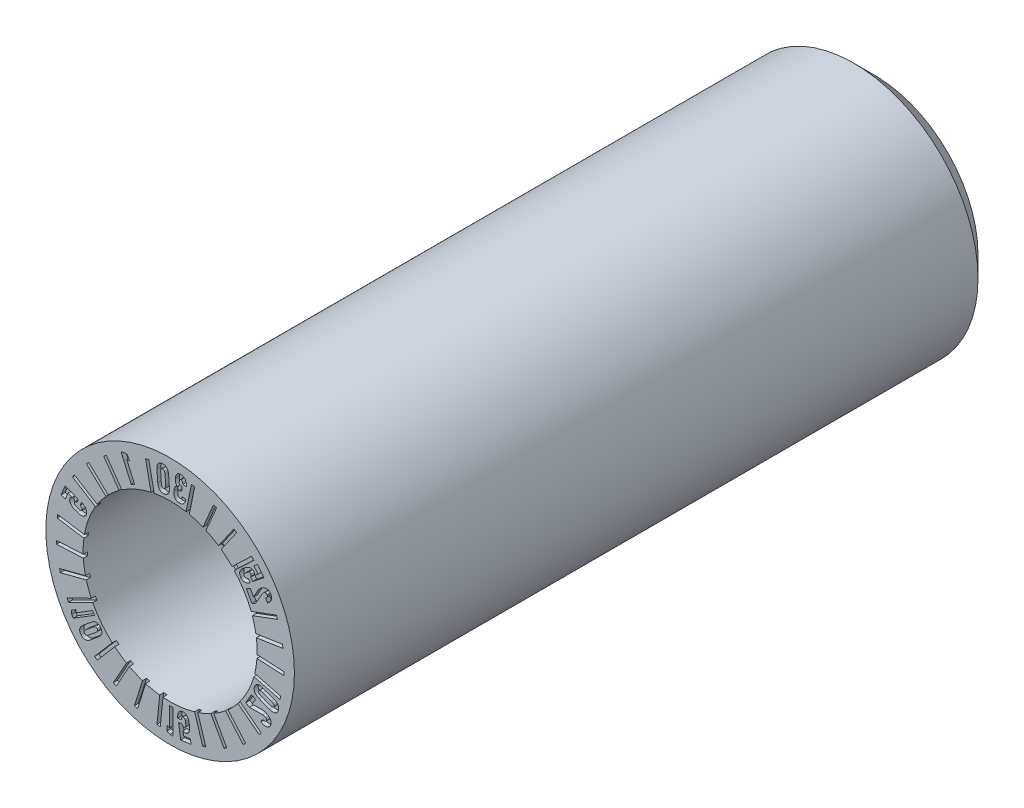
from build123d import *

# Parameters (mm, degrees)
CUT_EXTRUDE1_START = -0.1
CUT_EXTRUDE1_DEPTH = 0.1


with BuildPart() as part:
    # Sketch1 → Revolve1 (revolve)
    with BuildSketch(Plane(origin=(0, 0, 0), x_dir=(0, 0, -1), z_dir=(1, 0, 0)), mode=Mode.PRIVATE) as revolve1_sk:
        Polygon((17, 1.5), (17, 2.5), (16.5, 3), (0, 3), (0, 2.1), (3, 2.1), (3, 0.8), (12, 0.8), (12, 1.5), align=None)
    revolve(revolve1_sk.sketch.rotate(Axis((0, 0, 0), (0, 0, -1)), 90), axis=Axis((0, 0, 0), (0, 0, -1)))

    # Sketch2 → Cut-Extrude1 (cut)
    # profile 1 of 60: a face of its own
    with BuildSketch(Plane.XY.offset(CUT_EXTRUDE1_START)):
        with BuildLine():
            add(Edge.make_bspline(
                [(-2.022395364, 0.804520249), (-2.01781332, 0.815812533), (-2.013477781, 0.833704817), (-2.01341987, 0.85806027), (-2.016320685, 0.876172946), (-2.021922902, 0.894062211), (-2.030540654, 0.911444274), (-2.041835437, 0.928374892), (-2.055934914, 0.944651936), (-2.07263544, 0.96011942), (-2.099245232, 0.979670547), (-2.121459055, 0.992135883), (-2.137360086, 0.999292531)],
                knots=[0, 0, 0, 0, 0.145465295, 0.21709738, 0.289641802, 0.363737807, 0.440147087, 0.520570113, 0.6062151, 0.696770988, 0.791877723, 1, 1, 1, 1], degree=3))
            Line((-2.137360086, 0.999292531), (-2.137710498, 0.999455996))
            Line((-2.137710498, 0.999455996), (-2.170668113, 0.916824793))
            Line((-2.170668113, 0.916824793), (-2.170317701, 0.916661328))
            add(Edge.make_bspline(
                [(-2.170317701, 0.916661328), (-2.161410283, 0.912320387), (-2.149187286, 0.904909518), (-2.135753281, 0.89271284), (-2.12853878, 0.883357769), (-2.123509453, 0.87370954), (-2.120332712, 0.860279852), (-2.1220155, 0.850018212), (-2.124485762, 0.843782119)],
                knots=[0, 0, 0, 0, 0.312565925, 0.447531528, 0.56988102, 0.683318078, 0.788125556, 1, 1, 1, 1], degree=3))
            add(Edge.make_bspline(
                [(-2.124485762, 0.843782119), (-2.127095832, 0.837180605), (-2.133127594, 0.827911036), (-2.145416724, 0.82031004), (-2.15612953, 0.816952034), (-2.168256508, 0.815764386), (-2.187276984, 0.817205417), (-2.201611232, 0.822130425), (-2.211440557, 0.825764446)],
                knots=[0, 0, 0, 0, 0.214906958, 0.318693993, 0.428977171, 0.5498672, 0.683154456, 1, 1, 1, 1], degree=3))
            Line((-2.211440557, 0.825764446), (-2.258044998, 0.84430513))
            add(Edge.make_bspline(
                [(-2.258044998, 0.84430513), (-2.267724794, 0.848285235), (-2.281389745, 0.854540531), (-2.296245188, 0.866111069), (-2.304451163, 0.874645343), (-2.310015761, 0.88376576), (-2.314210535, 0.896367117), (-2.312569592, 0.906345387), (-2.310229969, 0.912254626)],
                knots=[0, 0, 0, 0, 0.329808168, 0.465965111, 0.588971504, 0.699113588, 0.798730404, 1, 1, 1, 1], degree=3))
            add(Edge.make_bspline(
                [(-2.310229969, 0.912254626), (-2.308043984, 0.917885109), (-2.303241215, 0.925607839), (-2.294470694, 0.933824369), (-2.286623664, 0.938333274), (-2.277983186, 0.941615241), (-2.264852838, 0.944076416), (-2.25452968, 0.943696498), (-2.247565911, 0.942499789)],
                knots=[0, 0, 0, 0, 0.238623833, 0.355233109, 0.472856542, 0.59497689, 0.720064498, 1, 1, 1, 1], degree=3))
            Line((-2.247565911, 0.942499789), (-2.216798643, 1.019795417))
            Line((-2.216798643, 1.019795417), (-2.53621781, 1.147170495))
            Line((-2.53621781, 1.147170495), (-2.630233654, 0.911517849))
            Line((-2.630233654, 0.911517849), (-2.529413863, 0.871270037))
            Line((-2.529413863, 0.871270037), (-2.468355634, 1.024291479))
            Line((-2.468355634, 1.024291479), (-2.370161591, 0.985183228))
            add(Edge.make_bspline(
                [(-2.370161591, 0.985183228), (-2.375294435, 0.983437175), (-2.382816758, 0.979757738), (-2.392013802, 0.973070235), (-2.39859832, 0.966882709), (-2.404757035, 0.960176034), (-2.411522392, 0.950406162), (-2.416017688, 0.94285381), (-2.417989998, 0.93735061)],
                knots=[0, 0, 0, 0, 0.233328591, 0.358376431, 0.488643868, 0.622173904, 0.749846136, 1, 1, 1, 1], degree=3))
            add(Edge.make_bspline(
                [(-2.417989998, 0.93735061), (-2.422117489, 0.926619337), (-2.426463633, 0.909827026), (-2.425375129, 0.887213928), (-2.421834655, 0.87082726), (-2.415035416, 0.854911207), (-2.405679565, 0.839318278), (-2.39302081, 0.824621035), (-2.377923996, 0.810274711), (-2.359896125, 0.79681305), (-2.331473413, 0.779003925), (-2.307638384, 0.768247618), (-2.290997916, 0.761501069)],
                knots=[0, 0, 0, 0, 0.142472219, 0.209677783, 0.277733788, 0.348186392, 0.422229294, 0.501188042, 0.586665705, 0.678727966, 0.778224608, 1, 1, 1, 1], degree=3))
            Line((-2.290997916, 0.761501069), (-2.244393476, 0.742960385))
            add(Edge.make_bspline(
                [(-2.244393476, 0.742960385), (-2.227713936, 0.736233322), (-2.202759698, 0.728223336), (-2.169522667, 0.722497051), (-2.146700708, 0.721127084), (-2.125279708, 0.722483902), (-2.105225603, 0.726154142), (-2.086818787, 0.732904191), (-2.070000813, 0.742122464), (-2.055031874, 0.754015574), (-2.037123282, 0.773686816), (-2.027504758, 0.7917498), (-2.022395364, 0.804520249)],
                knots=[0, 0, 0, 0, 0.207252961, 0.300633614, 0.387934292, 0.470002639, 0.547407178, 0.621957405, 0.694874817, 0.767458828, 0.841195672, 1, 1, 1, 1], degree=3))
        make_face()
    # profile 2 of 60: a face of its own
    with BuildSketch(Plane.XY.offset(CUT_EXTRUDE1_START)):
        Polygon((-2.377522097, -1.458745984), (-2.337512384, -1.523046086), (-1.826160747, -1.20528236), (-1.873013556, -1.129974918), (-2.271185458, -1.377430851), (-2.277833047, -1.314035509), (-2.380223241, -1.37766549), align=None)
    # profile 3 of 60: a face of its own
    with BuildSketch(Plane.XY.offset(CUT_EXTRUDE1_START)):
        with BuildLine():
            Line((-1.92967421, -1.773711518), (-1.720340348, -1.600493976))
            add(Edge.make_bspline(
                [(-1.720340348, -1.600493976), (-1.710545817, -1.592380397), (-1.696840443, -1.579829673), (-1.680916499, -1.561702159), (-1.670827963, -1.548412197), (-1.662446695, -1.534787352), (-1.655505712, -1.521149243), (-1.650340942, -1.507226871), (-1.64661603, -1.493303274), (-1.644502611, -1.479286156), (-1.644167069, -1.465323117), (-1.64570496, -1.451470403), (-1.648769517, -1.437710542), (-1.653730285, -1.424144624), (-1.662768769, -1.405708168), (-1.671891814, -1.392806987), (-1.678714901, -1.384496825)],
                knots=[0, 0, 0, 0, 0.152741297, 0.222475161, 0.289434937, 0.352771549, 0.414267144, 0.472825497, 0.530692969, 0.587013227, 0.642595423, 0.697849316, 0.753937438, 0.811416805, 0.870815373, 1, 1, 1, 1], degree=3))
            add(Edge.make_bspline(
                [(-1.678714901, -1.384496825), (-1.685653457, -1.376240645), (-1.696633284, -1.364719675), (-1.713140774, -1.352283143), (-1.725688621, -1.34494511), (-1.738643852, -1.339291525), (-1.75201935, -1.335343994), (-1.765844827, -1.333026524), (-1.780043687, -1.332601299), (-1.79450723, -1.333730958), (-1.809127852, -1.336253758), (-1.823843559, -1.340494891), (-1.838695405, -1.346279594), (-1.853659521, -1.353637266), (-1.874313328, -1.365792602), (-1.889110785, -1.376783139), (-1.898806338, -1.384794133)],
                knots=[0, 0, 0, 0, 0.129560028, 0.189938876, 0.247487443, 0.303619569, 0.359153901, 0.41444644, 0.471382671, 0.529169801, 0.588309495, 0.649122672, 0.712637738, 0.7793568, 0.849023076, 1, 1, 1, 1], degree=3))
            Line((-1.898806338, -1.384794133), (-2.1081402, -1.558011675))
            add(Edge.make_bspline(
                [(-2.1081402, -1.558011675), (-2.117834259, -1.5661758), (-2.131731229, -1.578544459), (-2.147522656, -1.596793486), (-2.157657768, -1.610088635), (-2.16601121, -1.623687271), (-2.172965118, -1.637322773), (-2.178263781, -1.651201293), (-2.182023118, -1.6651773), (-2.183936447, -1.679223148), (-2.184323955, -1.69318081), (-2.182774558, -1.707036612), (-2.179704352, -1.720791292), (-2.174770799, -1.734398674), (-2.165517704, -1.752756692), (-2.156516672, -1.765745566), (-2.149645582, -1.774031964)],
                knots=[0, 0, 0, 0, 0.15227182, 0.22239804, 0.289328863, 0.35263809, 0.413636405, 0.472734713, 0.530577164, 0.586896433, 0.642454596, 0.697684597, 0.753748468, 0.811202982, 0.870871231, 1, 1, 1, 1], degree=3))
            add(Edge.make_bspline(
                [(-2.149645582, -1.774031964), (-2.14284581, -1.782433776), (-2.131709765, -1.793671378), (-2.115395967, -1.806252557), (-2.102969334, -1.813625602), (-2.090094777, -1.819413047), (-2.076823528, -1.823513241), (-2.063069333, -1.825692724), (-2.049001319, -1.826438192), (-2.03458938, -1.825483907), (-2.02002787, -1.822639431), (-2.00525717, -1.818570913), (-1.990387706, -1.812716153), (-1.975323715, -1.805370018), (-1.954571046, -1.792871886), (-1.939491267, -1.781859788), (-1.92967421, -1.773711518)],
                knots=[0, 0, 0, 0, 0.129456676, 0.188898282, 0.24655354, 0.302262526, 0.357791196, 0.412540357, 0.468793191, 0.526396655, 0.585198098, 0.646387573, 0.70983958, 0.776492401, 0.847102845, 1, 1, 1, 1], degree=3))
        make_face()
        with BuildLine():
            Line((-2.029663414, -1.607628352), (-1.864771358, -1.471173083))
            add(Edge.make_bspline(
                [(-1.864771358, -1.471173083), (-1.854684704, -1.463230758), (-1.840190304, -1.451944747), (-1.819421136, -1.442224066), (-1.805904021, -1.437955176), (-1.793174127, -1.436766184), (-1.777156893, -1.439720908), (-1.767258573, -1.447400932), (-1.76228123, -1.453691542)],
                knots=[0, 0, 0, 0, 0.33149101, 0.467296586, 0.587731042, 0.694234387, 0.792721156, 1, 1, 1, 1], degree=3))
            add(Edge.make_bspline(
                [(-1.76228123, -1.453691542), (-1.757186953, -1.459795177), (-1.751317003, -1.470881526), (-1.751465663, -1.487173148), (-1.75507022, -1.499426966), (-1.761691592, -1.511954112), (-1.775242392, -1.530464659), (-1.78894228, -1.542687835), (-1.798720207, -1.551020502)],
                knots=[0, 0, 0, 0, 0.206456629, 0.305746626, 0.411944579, 0.53202433, 0.668485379, 1, 1, 1, 1], degree=3))
            Line((-1.798720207, -1.551020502), (-1.963612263, -1.687475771))
            add(Edge.make_bspline(
                [(-1.963612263, -1.687475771), (-1.973592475, -1.695553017), (-1.988281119, -1.706474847), (-2.008924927, -1.716452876), (-2.022480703, -1.720673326), (-2.035216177, -1.721926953), (-2.051152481, -1.718720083), (-2.061002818, -1.711150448), (-2.065959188, -1.704860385)],
                knots=[0, 0, 0, 0, 0.331136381, 0.46770859, 0.588275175, 0.694895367, 0.793495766, 1, 1, 1, 1], degree=3))
            add(Edge.make_bspline(
                [(-2.065959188, -1.704860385), (-2.071105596, -1.69876211), (-2.07681188, -1.68769037), (-2.07692137, -1.671462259), (-2.073492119, -1.659154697), (-2.066644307, -1.646731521), (-2.053188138, -1.628160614), (-2.039412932, -1.6159753), (-2.029663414, -1.607628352)],
                knots=[0, 0, 0, 0, 0.20658117, 0.305108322, 0.411292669, 0.531742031, 0.668285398, 1, 1, 1, 1], degree=3))
        make_face(mode=Mode.SUBTRACT)
    # profile 4 of 60: a face of its own
    with BuildSketch(Plane.XY.offset(CUT_EXTRUDE1_START)):
        with BuildLine():
            add(Edge.make_bspline(
                [(0.296313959, -2.155987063), (0.284237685, -2.157592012), (0.266528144, -2.162625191), (0.245489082, -2.174758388), (0.231257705, -2.186237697), (0.218557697, -2.199979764), (0.207712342, -2.216069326), (0.198638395, -2.234295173), (0.191454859, -2.254616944), (0.186283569, -2.276864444), (0.182102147, -2.309716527), (0.182600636, -2.335305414), (0.184120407, -2.352685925)],
                knots=[0, 0, 0, 0, 0.145429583, 0.216703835, 0.288639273, 0.362906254, 0.439218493, 0.519467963, 0.605325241, 0.695916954, 0.791618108, 1, 1, 1, 1], degree=3))
            Line((0.184120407, -2.352685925), (0.1841348, -2.353189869))
            Line((0.1841348, -2.353189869), (0.27213629, -2.340945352))
            Line((0.27213629, -2.340945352), (0.272121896, -2.340441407))
            add(Edge.make_bspline(
                [(0.272121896, -2.340441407), (0.271502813, -2.330516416), (0.271804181, -2.3162248), (0.275720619, -2.29848228), (0.28028634, -2.287595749), (0.286302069, -2.278535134), (0.296116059, -2.268909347), (0.306006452, -2.265533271), (0.312558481, -2.264582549)],
                knots=[0, 0, 0, 0, 0.31415548, 0.447734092, 0.571297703, 0.684465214, 0.789201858, 1, 1, 1, 1], degree=3))
            add(Edge.make_bspline(
                [(0.312558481, -2.264582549), (0.31958658, -2.263514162), (0.330541, -2.264320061), (0.343267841, -2.271124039), (0.351512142, -2.278795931), (0.358440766, -2.288907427), (0.366663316, -2.306154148), (0.369651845, -2.321062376), (0.371193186, -2.331440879)],
                knots=[0, 0, 0, 0, 0.214081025, 0.317152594, 0.428261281, 0.549099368, 0.68337942, 1, 1, 1, 1], degree=3))
            Line((0.371193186, -2.331440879), (0.378076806, -2.381323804))
            add(Edge.make_bspline(
                [(0.378076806, -2.381323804), (0.379396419, -2.391772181), (0.380555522, -2.406790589), (0.378029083, -2.425530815), (0.374702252, -2.436882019), (0.369671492, -2.44635661), (0.360531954, -2.455969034), (0.351239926, -2.459671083), (0.344913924, -2.460475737)],
                knots=[0, 0, 0, 0, 0.330824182, 0.467449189, 0.590332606, 0.699566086, 0.800283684, 1, 1, 1, 1], degree=3))
            add(Edge.make_bspline(
                [(0.344913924, -2.460475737), (0.338925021, -2.461565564), (0.329928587, -2.460927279), (0.318487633, -2.457453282), (0.310773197, -2.452837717), (0.303550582, -2.446958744), (0.295003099, -2.436587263), (0.290024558, -2.427482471), (0.287678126, -2.420782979)],
                knots=[0, 0, 0, 0, 0.238586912, 0.352754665, 0.470329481, 0.592128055, 0.719980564, 1, 1, 1, 1], degree=3))
            Line((0.287678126, -2.420782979), (0.205525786, -2.432148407))
            Line((0.205525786, -2.432148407), (0.252788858, -2.7739679))
            Line((0.252788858, -2.7739679), (0.503413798, -2.739337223))
            Line((0.503413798, -2.739337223), (0.488493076, -2.631386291))
            Line((0.488493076, -2.631386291), (0.325902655, -2.653890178))
            Line((0.325902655, -2.653890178), (0.311421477, -2.54886382))
            add(Edge.make_bspline(
                [(0.311421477, -2.54886382), (0.315494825, -2.552367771), (0.322149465, -2.557519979), (0.332644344, -2.561890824), (0.349504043, -2.567350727), (0.364614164, -2.568504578), (0.376318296, -2.566976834)],
                knots=[0, 0, 0, 0, 0.233613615, 0.358922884, 0.489992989, 1, 1, 1, 1], degree=3))
            add(Edge.make_bspline(
                [(0.376318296, -2.566976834), (0.38765119, -2.565277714), (0.404333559, -2.560638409), (0.423566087, -2.548625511), (0.43594684, -2.537250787), (0.446482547, -2.523559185), (0.455176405, -2.507611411), (0.46185632, -2.489416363), (0.466719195, -2.469128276), (0.46949407, -2.446803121), (0.470765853, -2.413189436), (0.468593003, -2.387077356), (0.466111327, -2.369197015)],
                knots=[0, 0, 0, 0, 0.141613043, 0.209642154, 0.277704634, 0.347723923, 0.421602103, 0.500666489, 0.585896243, 0.678164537, 0.777439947, 1, 1, 1, 1], degree=3))
            Line((0.466111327, -2.369197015), (0.459227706, -2.31931409))
            add(Edge.make_bspline(
                [(0.459227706, -2.31931409), (0.456954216, -2.30137389), (0.451254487, -2.275770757), (0.440123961, -2.243816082), (0.429999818, -2.223234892), (0.418427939, -2.205044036), (0.405107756, -2.189566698), (0.390284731, -2.176796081), (0.373995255, -2.166687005), (0.356301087, -2.159479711), (0.330372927, -2.153548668), (0.309925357, -2.154304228), (0.296313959, -2.155987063)],
                knots=[0, 0, 0, 0, 0.207840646, 0.300930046, 0.388682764, 0.471158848, 0.548363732, 0.622764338, 0.695449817, 0.767965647, 0.841624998, 1, 1, 1, 1], degree=3))
        make_face()
    # profile 5 of 60: a face of its own
    with BuildSketch(Plane.XY.offset(CUT_EXTRUDE1_START)):
        Polygon((-0.003158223, -2.787292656), (0.072895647, -2.786876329), (0.069760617, -2.186880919), (-0.019254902, -2.187287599), (-0.016784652, -2.654493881), (-0.074493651, -2.627115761), (-0.073816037, -2.747310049), align=None)
    # profile 6 of 60: a face of its own
    with BuildSketch(Plane.XY.offset(CUT_EXTRUDE1_START)):
        with BuildLine():
            Line((2.501052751, -0.791415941), (2.246824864, -0.694432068))
            add(Edge.make_bspline(
                [(2.246824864, -0.694432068), (2.234993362, -0.689768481), (2.217214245, -0.684290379), (2.193578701, -0.679279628), (2.176945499, -0.677232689), (2.160965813, -0.676630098), (2.145624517, -0.677247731), (2.130916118, -0.679663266), (2.116891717, -0.683395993), (2.103568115, -0.688567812), (2.091270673, -0.695433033), (2.079791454, -0.703568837), (2.06934692, -0.713268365), (2.059932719, -0.724481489), (2.04817182, -0.741659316), (2.041515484, -0.756240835), (2.037508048, -0.766331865)],
                knots=[0, 0, 0, 0, 0.151550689, 0.221424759, 0.287888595, 0.351122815, 0.411965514, 0.470651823, 0.52848452, 0.584787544, 0.640599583, 0.696012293, 0.752212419, 0.810061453, 0.870289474, 1, 1, 1, 1], degree=3))
            add(Edge.make_bspline(
                [(2.037508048, -0.766331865), (2.033771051, -0.77662202), (2.028985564, -0.792012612), (2.026262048, -0.812756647), (2.025953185, -0.827428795), (2.02743266, -0.841669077), (2.030451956, -0.85545322), (2.035278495, -0.868733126), (2.041839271, -0.881419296), (2.049772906, -0.89365907), (2.059409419, -0.905094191), (2.070305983, -0.915935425), (2.082525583, -0.926218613), (2.096318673, -0.93560716), (2.117153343, -0.947505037), (2.133960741, -0.955174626), (2.145789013, -0.959582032)],
                knots=[0, 0, 0, 0, 0.130722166, 0.19095447, 0.248869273, 0.305247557, 0.361220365, 0.416667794, 0.473144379, 0.531138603, 0.590165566, 0.651019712, 0.714195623, 0.780242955, 0.849607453, 1, 1, 1, 1], degree=3))
            Line((2.145789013, -0.959582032), (2.4000169, -1.056565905))
            add(Edge.make_bspline(
                [(2.4000169, -1.056565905), (2.411898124, -1.061184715), (2.429677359, -1.066807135), (2.453356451, -1.071787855), (2.470011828, -1.073876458), (2.48605406, -1.07435749), (2.501440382, -1.073628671), (2.51617935, -1.071237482), (2.530203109, -1.067497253), (2.543526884, -1.062327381), (2.555824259, -1.055461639), (2.567303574, -1.047326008), (2.577747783, -1.037626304), (2.587163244, -1.026413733), (2.598924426, -1.009222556), (2.605617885, -0.994642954), (2.609494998, -0.984482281)],
                knots=[0, 0, 0, 0, 0.151800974, 0.221588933, 0.287970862, 0.351434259, 0.412540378, 0.471154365, 0.528915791, 0.585149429, 0.640892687, 0.696237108, 0.752367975, 0.810145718, 0.870299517, 1, 1, 1, 1], degree=3))
            add(Edge.make_bspline(
                [(2.609494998, -0.984482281), (2.613384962, -0.974299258), (2.618051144, -0.958916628), (2.620698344, -0.938224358), (2.621270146, -0.92358373), (2.619830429, -0.909394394), (2.616943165, -0.895641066), (2.612045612, -0.882450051), (2.605757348, -0.869700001), (2.597852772, -0.857552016), (2.588289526, -0.846167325), (2.577446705, -0.835317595), (2.565024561, -0.825151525), (2.551187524, -0.815623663), (2.530115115, -0.803521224), (2.51300623, -0.795974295), (2.501052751, -0.791415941)],
                knots=[0, 0, 0, 0, 0.129965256, 0.19013335, 0.248047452, 0.304011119, 0.35953323, 0.41492155, 0.471070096, 0.528535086, 0.587019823, 0.647809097, 0.710930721, 0.777871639, 0.847638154, 1, 1, 1, 1], degree=3))
        make_face()
        with BuildLine():
            Line((2.405065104, -0.962745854), (2.204515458, -0.8863427))
            add(Edge.make_bspline(
                [(2.204515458, -0.8863427), (2.19254902, -0.881655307), (2.175803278, -0.874185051), (2.15690078, -0.861150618), (2.146535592, -0.851364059), (2.139390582, -0.84072322), (2.133972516, -0.825196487), (2.136220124, -0.812652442), (2.138989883, -0.80510443)],
                knots=[0, 0, 0, 0, 0.329551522, 0.465923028, 0.586028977, 0.692049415, 0.791149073, 1, 1, 1, 1], degree=3))
            add(Edge.make_bspline(
                [(2.138989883, -0.80510443), (2.141713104, -0.797493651), (2.148663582, -0.787006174), (2.162869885, -0.778826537), (2.175321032, -0.775681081), (2.189594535, -0.775353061), (2.212408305, -0.778082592), (2.229884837, -0.783823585), (2.241949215, -0.788240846)],
                knots=[0, 0, 0, 0, 0.207711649, 0.306685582, 0.41345721, 0.533002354, 0.670180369, 1, 1, 1, 1], degree=3))
            Line((2.241949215, -0.788240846), (2.44249886, -0.864644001))
            add(Edge.make_bspline(
                [(2.44249886, -0.864644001), (2.454471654, -0.869327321), (2.47120052, -0.876808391), (2.490092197, -0.889805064), (2.500411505, -0.89961586), (2.507673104, -0.910227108), (2.512806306, -0.925847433), (2.510966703, -0.938311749), (2.507932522, -0.945801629)],
                knots=[0, 0, 0, 0, 0.329799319, 0.466273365, 0.585427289, 0.692534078, 0.792239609, 1, 1, 1, 1], degree=3))
            add(Edge.make_bspline(
                [(2.507932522, -0.945801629), (2.505098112, -0.953380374), (2.498331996, -0.964042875), (2.484080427, -0.972302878), (2.471546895, -0.975132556), (2.457335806, -0.97572236), (2.434557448, -0.972761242), (2.417060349, -0.967466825), (2.405065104, -0.962745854)],
                knots=[0, 0, 0, 0, 0.208706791, 0.307671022, 0.414156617, 0.53441162, 0.670124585, 1, 1, 1, 1], degree=3))
        make_face(mode=Mode.SUBTRACT)
    # profile 7 of 60: a face of its own
    with BuildSketch(Plane.XY.offset(CUT_EXTRUDE1_START)):
        with BuildLine():
            Line((1.823590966, -1.208574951), (1.911819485, -1.260016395))
            Line((1.911819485, -1.260016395), (2.227731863, -1.25654448))
            add(Edge.make_bspline(
                [(2.227731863, -1.25654448), (2.241409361, -1.256395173), (2.267336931, -1.258598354), (2.291877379, -1.26737981), (2.302417, -1.273434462)],
                knots=[0, 0, 0, 0, 0.530461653, 1, 1, 1, 1], degree=3))
            Line((2.302417, -1.273434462), (2.303041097, -1.273779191))
            add(Edge.make_bspline(
                [(2.303041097, -1.273779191), (2.309332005, -1.277503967), (2.317959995, -1.283806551), (2.326102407, -1.294759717), (2.329725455, -1.303279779), (2.331437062, -1.312296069), (2.33032314, -1.325256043), (2.326634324, -1.334617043), (2.323074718, -1.340471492)],
                knots=[0, 0, 0, 0, 0.277860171, 0.397297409, 0.512307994, 0.6255352, 0.741072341, 1, 1, 1, 1], degree=3))
            add(Edge.make_bspline(
                [(2.323074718, -1.340471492), (2.319729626, -1.346514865), (2.312554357, -1.354394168), (2.299797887, -1.360313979), (2.288943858, -1.362492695), (2.276912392, -1.362478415), (2.258490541, -1.359910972), (2.244874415, -1.354226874), (2.2356266, -1.350070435)],
                knots=[0, 0, 0, 0, 0.213063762, 0.316457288, 0.42888981, 0.551528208, 0.685737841, 1, 1, 1, 1], degree=3))
            Line((2.2356266, -1.350070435), (2.23523099, -1.34987587))
            Line((2.23523099, -1.34987587), (2.189127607, -1.428787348))
            Line((2.189127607, -1.428787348), (2.189523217, -1.428981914))
            add(Edge.make_bspline(
                [(2.189523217, -1.428981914), (2.205223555, -1.436844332), (2.228667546, -1.447543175), (2.260826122, -1.456003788), (2.283319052, -1.459799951), (2.304848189, -1.460757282), (2.325266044, -1.459361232), (2.344435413, -1.455103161), (2.362240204, -1.448168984), (2.378670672, -1.438903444), (2.398433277, -1.422625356), (2.410426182, -1.40730195), (2.416926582, -1.396001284)],
                knots=[0, 0, 0, 0, 0.206025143, 0.299834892, 0.388679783, 0.47260667, 0.551578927, 0.627647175, 0.701554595, 0.774570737, 0.847535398, 1, 1, 1, 1], degree=3))
            add(Edge.make_bspline(
                [(2.416926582, -1.396001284), (2.42388208, -1.38413685), (2.432420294, -1.365733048), (2.438180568, -1.340061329), (2.439573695, -1.321634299), (2.438355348, -1.303534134), (2.433886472, -1.286047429), (2.427113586, -1.268957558), (2.417189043, -1.252719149), (2.404872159, -1.237041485), (2.38394223, -1.21693372), (2.365543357, -1.204047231), (2.352248, -1.196318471)],
                knots=[0, 0, 0, 0, 0.173312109, 0.25281544, 0.32993306, 0.405183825, 0.480015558, 0.556187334, 0.635703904, 0.718622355, 0.806489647, 1, 1, 1, 1], degree=3))
            Line((2.352248, -1.196318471), (2.35185239, -1.196123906))
            add(Edge.make_bspline(
                [(2.35185239, -1.196123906), (2.340038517, -1.189358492), (2.321664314, -1.180182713), (2.295942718, -1.170682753), (2.276150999, -1.16464787), (2.256149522, -1.160170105), (2.229902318, -1.156027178), (2.210219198, -1.154908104), (2.19721798, -1.155219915)],
                knots=[0, 0, 0, 0, 0.252379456, 0.379565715, 0.507830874, 0.635581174, 0.759100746, 1, 1, 1, 1], degree=3))
            Line((2.19721798, -1.155219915), (1.977314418, -1.161655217))
            Line((1.977314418, -1.161655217), (2.058872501, -1.022026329))
            Line((2.058872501, -1.022026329), (1.964614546, -0.96701487))
            Line((1.964614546, -0.96701487), (1.823590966, -1.208574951))
        make_face()
    # profile 8 of 60: a face of its own
    with BuildSketch(Plane.XY.offset(CUT_EXTRUDE1_START)):
        with BuildLine():
            add(Edge.make_bspline(
                [(1.707847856, 1.349235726), (1.715296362, 1.339468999), (1.728834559, 1.326895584), (1.749951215, 1.314617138), (1.767112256, 1.307980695), (1.785524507, 1.303997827), (1.805024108, 1.302633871), (1.82544781, 1.304204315), (1.846720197, 1.308184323), (1.868568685, 1.314947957), (1.899093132, 1.328063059), (1.921088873, 1.341280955), (1.935356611, 1.351486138)],
                knots=[0, 0, 0, 0, 0.145564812, 0.216803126, 0.289117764, 0.363216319, 0.439795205, 0.520501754, 0.605900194, 0.696417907, 0.791615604, 1, 1, 1, 1], degree=3))
            Line((1.935356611, 1.351486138), (1.935651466, 1.351666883))
            Line((1.935651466, 1.351666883), (1.880325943, 1.421903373))
            Line((1.880325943, 1.421903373), (1.880031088, 1.421722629))
            add(Edge.make_bspline(
                [(1.880031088, 1.421722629), (1.871684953, 1.416333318), (1.859223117, 1.409048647), (1.841735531, 1.403759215), (1.829982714, 1.402013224), (1.819062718, 1.402618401), (1.805873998, 1.406624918), (1.797659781, 1.412994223), (1.793611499, 1.418440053)],
                knots=[0, 0, 0, 0, 0.313121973, 0.447855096, 0.57140233, 0.684352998, 0.788182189, 1, 1, 1, 1], degree=3))
            add(Edge.make_bspline(
                [(1.793611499, 1.418440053), (1.789116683, 1.424020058), (1.784215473, 1.433951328), (1.783723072, 1.448448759), (1.786068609, 1.459464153), (1.791185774, 1.470651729), (1.802124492, 1.486405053), (1.813327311, 1.496723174), (1.82163249, 1.503258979)],
                knots=[0, 0, 0, 0, 0.215103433, 0.317748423, 0.428740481, 0.549005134, 0.683264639, 1, 1, 1, 1], degree=3))
            Line((1.82163249, 1.503258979), (1.861313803, 1.534479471))
            add(Edge.make_bspline(
                [(1.861313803, 1.534479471), (1.869626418, 1.540911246), (1.882007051, 1.549515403), (1.899477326, 1.556798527), (1.911083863, 1.559456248), (1.921828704, 1.559861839), (1.934844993, 1.556820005), (1.942807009, 1.550665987), (1.946710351, 1.545552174)],
                knots=[0, 0, 0, 0, 0.328896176, 0.4665944, 0.588364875, 0.698843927, 0.799356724, 1, 1, 1, 1], degree=3))
            add(Edge.make_bspline(
                [(1.946710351, 1.545552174), (1.950535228, 1.540837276), (1.954889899, 1.532837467), (1.957540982, 1.5211023), (1.957533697, 1.512101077), (1.956172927, 1.502906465), (1.951545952, 1.490317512), (1.946153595, 1.481483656), (1.941706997, 1.475958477)],
                knots=[0, 0, 0, 0, 0.239591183, 0.354231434, 0.472311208, 0.593604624, 0.720007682, 1, 1, 1, 1], degree=3))
            Line((1.941706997, 1.475958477), (1.993370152, 1.410373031))
            Line((1.993370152, 1.410373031), (2.265132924, 1.62432186))
            Line((2.265132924, 1.62432186), (2.107560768, 1.824464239))
            Line((2.107560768, 1.824464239), (2.021692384, 1.75691972))
            Line((2.021692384, 1.75691972), (2.123939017, 1.627013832))
            Line((2.123939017, 1.627013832), (2.040367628, 1.561181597))
            add(Edge.make_bspline(
                [(2.040367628, 1.561181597), (2.041432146, 1.566520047), (2.042266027, 1.574914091), (2.040952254, 1.586270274), (2.038911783, 1.595105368), (2.036092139, 1.603794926), (2.031298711, 1.614715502), (2.026625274, 1.622219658), (2.023046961, 1.626826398)],
                knots=[0, 0, 0, 0, 0.233920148, 0.358398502, 0.489028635, 0.622519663, 0.749852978, 1, 1, 1, 1], degree=3))
            add(Edge.make_bspline(
                [(2.023046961, 1.626826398), (2.01590776, 1.635880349), (2.003310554, 1.647819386), (1.983217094, 1.658567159), (1.96701365, 1.663489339), (1.949820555, 1.665842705), (1.931541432, 1.665283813), (1.912350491, 1.661805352), (1.8922287, 1.655718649), (1.8714132, 1.64693008), (1.841709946, 1.631009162), (1.820342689, 1.615809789), (1.806107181, 1.604687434)],
                knots=[0, 0, 0, 0, 0.141546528, 0.209725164, 0.277898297, 0.348272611, 0.421797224, 0.501331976, 0.586948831, 0.679288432, 0.778148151, 1, 1, 1, 1], degree=3))
            Line((1.806107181, 1.604687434), (1.766425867, 1.573466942))
            add(Edge.make_bspline(
                [(1.766425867, 1.573466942), (1.752271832, 1.562214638), (1.732508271, 1.544714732), (1.710826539, 1.518571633), (1.698085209, 1.499425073), (1.688263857, 1.480176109), (1.681725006, 1.460783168), (1.677981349, 1.441452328), (1.677498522, 1.422160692), (1.680394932, 1.40311477), (1.688477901, 1.377609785), (1.699338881, 1.360112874), (1.707847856, 1.349235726)],
                knots=[0, 0, 0, 0, 0.207301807, 0.300824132, 0.388238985, 0.470211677, 0.547546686, 0.621857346, 0.694915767, 0.767378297, 0.841505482, 1, 1, 1, 1], degree=3))
        make_face()
    # profile 9 of 60: a face of its own
    with BuildSketch(Plane.XY.offset(CUT_EXTRUDE1_START)):
        with BuildLine():
            Line((1.975026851, 0.940570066), (2.063677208, 0.989941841))
            Line((2.063677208, 0.989941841), (2.220668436, 1.261941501))
            add(Edge.make_bspline(
                [(2.220668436, 1.261941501), (2.227568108, 1.273642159), (2.242562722, 1.294703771), (2.262438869, 1.31135686), (2.273070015, 1.317176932)],
                knots=[0, 0, 0, 0, 0.529779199, 1, 1, 1, 1], degree=3))
            Line((2.273070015, 1.317176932), (2.273600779, 1.317566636))
            add(Edge.make_bspline(
                [(2.273600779, 1.317566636), (2.27994891, 1.321074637), (2.289763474, 1.325278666), (2.303265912, 1.326408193), (2.312375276, 1.32531722), (2.320973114, 1.322262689), (2.331563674, 1.314848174), (2.337672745, 1.306888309), (2.340857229, 1.300892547)],
                knots=[0, 0, 0, 0, 0.277882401, 0.397736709, 0.51234836, 0.625008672, 0.741538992, 1, 1, 1, 1], degree=3))
            add(Edge.make_bspline(
                [(2.340857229, 1.300892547), (2.344049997, 1.29492353), (2.347436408, 1.284819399), (2.345894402, 1.270893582), (2.342228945, 1.260488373), (2.336286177, 1.250147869), (2.324600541, 1.235848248), (2.312989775, 1.22700689), (2.304684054, 1.221291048)],
                knots=[0, 0, 0, 0, 0.211858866, 0.317642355, 0.429326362, 0.552125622, 0.685953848, 1, 1, 1, 1], degree=3))
            Line((2.304684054, 1.221291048), (2.304386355, 1.221044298))
            Line((2.304386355, 1.221044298), (2.348519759, 1.141561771))
            Line((2.348519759, 1.141561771), (2.348817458, 1.14180852))
            add(Edge.make_bspline(
                [(2.348817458, 1.14180852), (2.363674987, 1.151064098), (2.384356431, 1.16612874), (2.408173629, 1.189071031), (2.422673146, 1.206515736), (2.434504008, 1.224391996), (2.443426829, 1.242693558), (2.449739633, 1.261158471), (2.452780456, 1.279924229), (2.452974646, 1.298613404), (2.449537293, 1.32381828), (2.442034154, 1.341721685), (2.435866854, 1.353074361)],
                knots=[0, 0, 0, 0, 0.206170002, 0.300119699, 0.388776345, 0.472799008, 0.551941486, 0.627965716, 0.701775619, 0.774794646, 0.847376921, 1, 1, 1, 1], degree=3))
            add(Edge.make_bspline(
                [(2.435866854, 1.353074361), (2.429214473, 1.364983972), (2.417856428, 1.381701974), (2.39874091, 1.399548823), (2.383722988, 1.41019911), (2.367525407, 1.418010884), (2.350424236, 1.42352088), (2.332311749, 1.425949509), (2.313389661, 1.425941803), (2.293781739, 1.423199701), (2.265978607, 1.41556865), (2.245607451, 1.406443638), (2.232328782, 1.398868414)],
                knots=[0, 0, 0, 0, 0.173120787, 0.253079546, 0.3300875, 0.405319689, 0.479922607, 0.556637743, 0.635686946, 0.718879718, 0.806511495, 1, 1, 1, 1], degree=3))
            Line((2.232328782, 1.398868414), (2.231927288, 1.398686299))
            add(Edge.make_bspline(
                [(2.231927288, 1.398686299), (2.220114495, 1.392066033), (2.203037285, 1.380897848), (2.181813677, 1.363773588), (2.166720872, 1.349829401), (2.152576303, 1.335132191), (2.135983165, 1.31459996), (2.124783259, 1.298530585), (2.118675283, 1.287138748)],
                knots=[0, 0, 0, 0, 0.252437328, 0.379585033, 0.508099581, 0.635390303, 0.759540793, 1, 1, 1, 1], degree=3))
            Line((2.118675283, 1.287138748), (2.012786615, 1.095814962))
            Line((2.012786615, 1.095814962), (1.934659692, 1.236366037))
            Line((1.934659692, 1.236366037), (1.839871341, 1.1836143))
            Line((1.839871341, 1.1836143), (1.975026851, 0.940570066))
        make_face()
    # profile 10 of 60: a face of its own
    with BuildSketch(Plane.XY.offset(CUT_EXTRUDE1_START)):
        Polygon((-1.112774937, 2.557267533), (-1.182550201, 2.526510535), (-0.939553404, 1.976212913), (-0.857826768, 2.01229894), (-1.046990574, 2.440771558), (-0.983098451, 2.438702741), (-1.031701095, 2.548831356), align=None)
    # profile 11 of 60: a face of its own
    with BuildSketch(Plane.XY.offset(CUT_EXTRUDE1_START)):
        with BuildLine():
            Line((-0.318291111, 2.605057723), (-0.300053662, 2.332240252))
            add(Edge.make_bspline(
                [(-0.300053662, 2.332240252), (-0.299381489, 2.319483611), (-0.296946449, 2.300944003), (-0.291632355, 2.277277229), (-0.286660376, 2.26116898), (-0.280418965, 2.246348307), (-0.273267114, 2.23262733), (-0.265039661, 2.220110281), (-0.255720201, 2.208895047), (-0.245495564, 2.1989089), (-0.23412308, 2.190613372), (-0.222032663, 2.183422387), (-0.208795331, 2.178134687), (-0.194765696, 2.174010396), (-0.174216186, 2.170850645), (-0.158276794, 2.17050597), (-0.147433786, 2.171300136)],
                knots=[0, 0, 0, 0, 0.151887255, 0.222003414, 0.288414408, 0.352171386, 0.413075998, 0.472289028, 0.530015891, 0.58628839, 0.641843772, 0.697136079, 0.753197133, 0.810954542, 0.870781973, 1, 1, 1, 1], degree=3))
            add(Edge.make_bspline(
                [(-0.147433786, 2.171300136), (-0.136493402, 2.171867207), (-0.120661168, 2.174427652), (-0.100670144, 2.180365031), (-0.087285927, 2.186317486), (-0.074981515, 2.193572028), (-0.06368387, 2.202090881), (-0.053807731, 2.212248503), (-0.04489875, 2.223463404), (-0.037202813, 2.235903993), (-0.030769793, 2.249419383), (-0.025549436, 2.263949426), (-0.021537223, 2.279463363), (-0.018504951, 2.295966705), (-0.016521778, 2.319999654), (-0.016643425, 2.338543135), (-0.017460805, 2.351186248)],
                knots=[0, 0, 0, 0, 0.130159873, 0.190120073, 0.247680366, 0.303978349, 0.359804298, 0.4154868, 0.472082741, 0.529958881, 0.589147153, 0.649888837, 0.713387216, 0.779646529, 0.849298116, 1, 1, 1, 1], degree=3))
            Line((-0.017460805, 2.351186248), (-0.035698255, 2.624003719))
            add(Edge.make_bspline(
                [(-0.035698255, 2.624003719), (-0.036716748, 2.63675024), (-0.038646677, 2.655420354), (-0.044294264, 2.679061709), (-0.049253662, 2.695156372), (-0.05532492, 2.710037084), (-0.062472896, 2.723715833), (-0.070756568, 2.736143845), (-0.080014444, 2.747404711), (-0.090383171, 2.757226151), (-0.101640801, 2.765720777), (-0.113832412, 2.772756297), (-0.127070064, 2.778112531), (-0.141127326, 2.782177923), (-0.161641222, 2.78561226), (-0.177623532, 2.78578091), (-0.188455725, 2.785048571)],
                knots=[0, 0, 0, 0, 0.15227709, 0.222408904, 0.288791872, 0.352398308, 0.413277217, 0.47202894, 0.529731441, 0.586282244, 0.64146825, 0.697120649, 0.753158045, 0.810891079, 0.870836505, 1, 1, 1, 1], degree=3))
            add(Edge.make_bspline(
                [(-0.188455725, 2.785048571), (-0.199398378, 2.784485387), (-0.215224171, 2.781913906), (-0.235225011, 2.775993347), (-0.248569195, 2.770003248), (-0.260905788, 2.762945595), (-0.272123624, 2.754477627), (-0.282010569, 2.7444894), (-0.290933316, 2.733389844), (-0.298642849, 2.721069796), (-0.3051275, 2.707648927), (-0.310310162, 2.693139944), (-0.314349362, 2.677593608), (-0.317354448, 2.660963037), (-0.319276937, 2.636644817), (-0.319132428, 2.617861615), (-0.318291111, 2.605057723)],
                knots=[0, 0, 0, 0, 0.130020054, 0.189915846, 0.247414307, 0.303465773, 0.358571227, 0.413899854, 0.470099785, 0.527541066, 0.586261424, 0.646937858, 0.710368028, 0.77701735, 0.847539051, 1, 1, 1, 1], degree=3))
        make_face()
        with BuildLine():
            Line((-0.122773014, 2.5891221), (-0.108429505, 2.374141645))
            add(Edge.make_bspline(
                [(-0.108429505, 2.374141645), (-0.107546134, 2.361231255), (-0.107482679, 2.34277389), (-0.11149691, 2.320052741), (-0.115915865, 2.30643239), (-0.122579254, 2.295403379), (-0.134500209, 2.284047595), (-0.146787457, 2.280803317), (-0.154802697, 2.280244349)],
                knots=[0, 0, 0, 0, 0.330463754, 0.467167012, 0.587066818, 0.693376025, 0.792554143, 1, 1, 1, 1], degree=3))
            add(Edge.make_bspline(
                [(-0.154802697, 2.280244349), (-0.162870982, 2.279601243), (-0.175275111, 2.281499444), (-0.188679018, 2.29098087), (-0.196522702, 2.301178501), (-0.202842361, 2.314002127), (-0.209942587, 2.335986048), (-0.212013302, 2.354340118), (-0.212995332, 2.367243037)],
                knots=[0, 0, 0, 0, 0.207493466, 0.305394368, 0.412258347, 0.532340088, 0.668836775, 1, 1, 1, 1], degree=3))
            Line((-0.212995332, 2.367243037), (-0.227338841, 2.582223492))
            add(Edge.make_bspline(
                [(-0.227338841, 2.582223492), (-0.228128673, 2.595137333), (-0.228376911, 2.613551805), (-0.224478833, 2.636317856), (-0.219706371, 2.649765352), (-0.21341913, 2.660995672), (-0.201239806, 2.672022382), (-0.189324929, 2.675731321), (-0.18120798, 2.676087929)],
                knots=[0, 0, 0, 0, 0.330842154, 0.467787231, 0.587447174, 0.694096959, 0.792854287, 1, 1, 1, 1], degree=3))
            add(Edge.make_bspline(
                [(-0.18120798, 2.676087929), (-0.173147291, 2.676726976), (-0.160661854, 2.674831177), (-0.14724339, 2.665251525), (-0.139213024, 2.655110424), (-0.132903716, 2.642287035), (-0.126079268, 2.620277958), (-0.123560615, 2.602070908), (-0.122773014, 2.5891221)],
                knots=[0, 0, 0, 0, 0.207313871, 0.306598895, 0.413910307, 0.533888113, 0.669057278, 1, 1, 1, 1], degree=3))
        make_face(mode=Mode.SUBTRACT)
    # profile 12 of 60: a face of its own
    with BuildSketch(Plane.XY.offset(CUT_EXTRUDE1_START)):
        with BuildLine():
            Line((0.091421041, 2.363590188), (0.089741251, 2.345478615))
            add(Edge.make_bspline(
                [(0.089741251, 2.345478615), (0.088183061, 2.329242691), (0.087387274, 2.305356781), (0.091573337, 2.274895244), (0.096593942, 2.254524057), (0.104038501, 2.236124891), (0.113467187, 2.219592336), (0.125091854, 2.205063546), (0.138858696, 2.192727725), (0.154594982, 2.182619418), (0.178573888, 2.171721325), (0.19853889, 2.167876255), (0.212140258, 2.166369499)],
                knots=[0, 0, 0, 0, 0.199145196, 0.289506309, 0.374196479, 0.454276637, 0.530708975, 0.605470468, 0.680126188, 0.755055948, 0.832679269, 1, 1, 1, 1], degree=3))
            add(Edge.make_bspline(
                [(0.212140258, 2.166369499), (0.225789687, 2.165074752), (0.246234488, 2.165357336), (0.272354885, 2.171355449), (0.29063906, 2.178238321), (0.307663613, 2.187815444), (0.323234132, 2.19991975), (0.337346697, 2.214376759), (0.349894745, 2.231219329), (0.360562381, 2.25037385), (0.372580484, 2.279461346), (0.37776202, 2.303178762), (0.379954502, 2.319514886)],
                knots=[0, 0, 0, 0, 0.161941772, 0.238809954, 0.315285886, 0.391714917, 0.468408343, 0.547249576, 0.629428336, 0.715517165, 0.805317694, 1, 1, 1, 1], degree=3))
            Line((0.379954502, 2.319514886), (0.288027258, 2.328555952))
            add(Edge.make_bspline(
                [(0.288027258, 2.328555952), (0.285610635, 2.317939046), (0.280802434, 2.302607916), (0.268201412, 2.287070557), (0.259445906, 2.280356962), (0.251740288, 2.276922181), (0.243437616, 2.275122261), (0.23704608, 2.274516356), (0.232721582, 2.275223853)],
                knots=[0, 0, 0, 0, 0.388971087, 0.550761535, 0.700691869, 0.774227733, 0.847082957, 1, 1, 1, 1], degree=3))
            add(Edge.make_bspline(
                [(0.232721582, 2.275223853), (0.225095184, 2.275981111), (0.213823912, 2.278980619), (0.201790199, 2.288141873), (0.194916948, 2.297012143), (0.189656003, 2.307601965), (0.185551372, 2.325074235), (0.185399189, 2.339135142), (0.186464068, 2.34883004)],
                knots=[0, 0, 0, 0, 0.235088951, 0.344659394, 0.45581353, 0.574712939, 0.702666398, 1, 1, 1, 1], degree=3))
            Line((0.186464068, 2.34883004), (0.187847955, 2.362887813))
            add(Edge.make_bspline(
                [(0.187847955, 2.362887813), (0.188867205, 2.37301672), (0.191218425, 2.387427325), (0.197808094, 2.404552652), (0.203662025, 2.414525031), (0.210709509, 2.422215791), (0.221546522, 2.429658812), (0.23158937, 2.430704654), (0.237895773, 2.430083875)],
                knots=[0, 0, 0, 0, 0.32655315, 0.463178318, 0.585323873, 0.694282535, 0.794826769, 1, 1, 1, 1], degree=3))
            Line((0.237895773, 2.430083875), (0.277885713, 2.426235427))
            Line((0.277885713, 2.426235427), (0.288634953, 2.535147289))
            Line((0.288634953, 2.535147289), (0.248645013, 2.538995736))
            add(Edge.make_bspline(
                [(0.248645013, 2.538995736), (0.243382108, 2.53938559), (0.23562004, 2.54233528), (0.228105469, 2.550315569), (0.223744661, 2.558086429), (0.220720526, 2.567536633), (0.217826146, 2.583044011), (0.218781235, 2.59561706), (0.219325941, 2.604299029)],
                knots=[0, 0, 0, 0, 0.198535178, 0.297802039, 0.407744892, 0.531560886, 0.670161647, 1, 1, 1, 1], degree=3))
            Line((0.219325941, 2.604299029), (0.220364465, 2.61468649))
            add(Edge.make_bspline(
                [(0.220364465, 2.61468649), (0.221308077, 2.622835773), (0.223065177, 2.634622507), (0.229054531, 2.648351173), (0.234352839, 2.656321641), (0.240584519, 2.662588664), (0.250514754, 2.668270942), (0.259198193, 2.669224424), (0.264828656, 2.668647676)],
                knots=[0, 0, 0, 0, 0.314860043, 0.448896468, 0.568857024, 0.678511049, 0.783342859, 1, 1, 1, 1], degree=3))
            add(Edge.make_bspline(
                [(0.264828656, 2.668647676), (0.268699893, 2.668109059), (0.27459386, 2.666753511), (0.281483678, 2.662607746), (0.286350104, 2.65869949), (0.290614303, 2.653752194), (0.294569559, 2.648118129), (0.297831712, 2.641522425), (0.300776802, 2.634221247), (0.30319611, 2.62612985), (0.305505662, 2.613833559), (0.306683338, 2.604201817), (0.306832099, 2.597494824)],
                knots=[0, 0, 0, 0, 0.131182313, 0.197376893, 0.266693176, 0.338457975, 0.414387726, 0.495686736, 0.583148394, 0.676771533, 0.776721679, 1, 1, 1, 1], degree=3))
            Line((0.306832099, 2.597494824), (0.398399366, 2.588524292))
            add(Edge.make_bspline(
                [(0.398399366, 2.588524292), (0.39881144, 2.605837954), (0.397797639, 2.631256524), (0.391461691, 2.663529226), (0.384904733, 2.685288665), (0.376308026, 2.705038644), (0.366125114, 2.722795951), (0.353979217, 2.738161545), (0.340269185, 2.751317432), (0.325035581, 2.762007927), (0.30296051, 2.773186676), (0.284762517, 2.77746924), (0.272432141, 2.778674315)],
                knots=[0, 0, 0, 0, 0.205912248, 0.300584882, 0.390039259, 0.475317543, 0.555933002, 0.632498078, 0.707172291, 0.78086062, 0.85275203, 1, 1, 1, 1], degree=3))
            add(Edge.make_bspline(
                [(0.272432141, 2.778674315), (0.262524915, 2.779706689), (0.247907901, 2.779908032), (0.228958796, 2.777526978), (0.215879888, 2.774216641), (0.203551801, 2.769640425), (0.191993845, 2.763677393), (0.181236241, 2.756318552), (0.171245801, 2.747612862), (0.162241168, 2.737623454), (0.15398381, 2.726558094), (0.146889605, 2.714215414), (0.140781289, 2.700717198), (0.135532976, 2.686122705), (0.129853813, 2.664410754), (0.127099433, 2.647329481), (0.126017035, 2.635540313)],
                knots=[0, 0, 0, 0, 0.128420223, 0.187774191, 0.245866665, 0.302043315, 0.357056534, 0.413193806, 0.469772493, 0.527569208, 0.586361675, 0.64754785, 0.710797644, 0.777271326, 0.847356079, 1, 1, 1, 1], degree=3))
            Line((0.126017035, 2.635540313), (0.124217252, 2.617452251))
            add(Edge.make_bspline(
                [(0.124217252, 2.617452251), (0.122793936, 2.604347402), (0.122949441, 2.584928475), (0.127578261, 2.560092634), (0.13326893, 2.543219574), (0.140976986, 2.527814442), (0.153828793, 2.50935921), (0.166667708, 2.498329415), (0.176095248, 2.492406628)],
                knots=[0, 0, 0, 0, 0.276788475, 0.405133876, 0.529423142, 0.649684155, 0.765985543, 1, 1, 1, 1], degree=3))
            add(Edge.make_bspline(
                [(0.176095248, 2.492406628), (0.1704041, 2.491289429), (0.161964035, 2.488883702), (0.151548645, 2.483789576), (0.14415099, 2.479151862), (0.13723838, 2.473609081), (0.130617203, 2.467305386), (0.124467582, 2.460111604), (0.116799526, 2.449229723), (0.108249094, 2.433761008), (0.097308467, 2.404446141), (0.093073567, 2.380347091), (0.091421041, 2.363590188)],
                knots=[0, 0, 0, 0, 0.1052354, 0.157993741, 0.209743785, 0.263201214, 0.318347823, 0.375263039, 0.434458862, 0.559474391, 0.694436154, 1, 1, 1, 1], degree=3))
        make_face()
    # profile 13 of 60: a face of its own
    with BuildSketch(Plane.XY.offset(CUT_EXTRUDE1_START)):
        with BuildLine():
            Line((0.441778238, 1.951007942), (0.461831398, 2.048587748))
            ThreePointArc((0.461831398, 2.048587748), (0.422726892, 2.057012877), (0.383469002, 2.064691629))
            Line((0.383469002, 2.064691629), (0.363415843, 1.967111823))
            Line((0.363415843, 1.967111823), (0.441778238, 1.951007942))
        make_face()
    # profile 14 of 60: a face of its own
    with BuildSketch(Plane.XY.offset(CUT_EXTRUDE1_START)):
        with BuildLine():
            Line((0.461831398, 2.048587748), (0.592752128, 2.685655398))
            Line((0.592752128, 2.685655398), (0.514389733, 2.701759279))
            Line((0.514389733, 2.701759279), (0.383469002, 2.064691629))
            ThreePointArc((0.383469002, 2.064691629), (0.422726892, 2.057012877), (0.461831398, 2.048587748))
        make_face()
    # profile 15 of 60: a face of its own
    with BuildSketch(Plane.XY.offset(CUT_EXTRUDE1_START)):
        with BuildLine():
            ThreePointArc((-0.461831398, 2.048587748), (-0.422726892, 2.057012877), (-0.383469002, 2.064691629))
            Line((-0.383469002, 2.064691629), (-0.514389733, 2.701759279))
            Line((-0.514389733, 2.701759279), (-0.592752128, 2.685655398))
            Line((-0.592752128, 2.685655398), (-0.461831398, 2.048587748))
        make_face()
    # profile 16 of 60: a face of its own
    with BuildSketch(Plane.XY.offset(CUT_EXTRUDE1_START)):
        with BuildLine():
            Line((-0.363415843, 1.967111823), (-0.383469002, 2.064691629))
            ThreePointArc((-0.383469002, 2.064691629), (-0.422726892, 2.057012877), (-0.461831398, 2.048587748))
            Line((-0.461831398, 2.048587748), (-0.441778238, 1.951007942))
            Line((-0.441778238, 1.951007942), (-0.363415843, 1.967111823))
        make_face()
    # profile 17 of 60: a face of its own
    with BuildSketch(Plane.XY.offset(CUT_EXTRUDE1_START)):
        with BuildLine():
            ThreePointArc((-1.232276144, 1.700439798), (-1.199663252, 1.723603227), (-1.166615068, 1.746141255))
            Line((-1.166615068, 1.746141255), (-1.538157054, 2.279950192))
            Line((-1.538157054, 2.279950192), (-1.603818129, 2.234248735))
            Line((-1.603818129, 2.234248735), (-1.232276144, 1.700439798))
        make_face()
    # profile 18 of 60: a face of its own
    with BuildSketch(Plane.XY.offset(CUT_EXTRUDE1_START)):
        with BuildLine():
            Line((-1.109705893, 1.664377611), (-1.166615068, 1.746141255))
            ThreePointArc((-1.166615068, 1.746141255), (-1.199663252, 1.723603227), (-1.232276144, 1.700439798))
            Line((-1.232276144, 1.700439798), (-1.175366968, 1.618676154))
            Line((-1.175366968, 1.618676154), (-1.109705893, 1.664377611))
        make_face()
    # profile 19 of 60: a face of its own
    with BuildSketch(Plane.XY.offset(CUT_EXTRUDE1_START)):
        with BuildLine():
            ThreePointArc((-1.549347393, 1.417576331), (-1.522064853, 1.44683053), (-1.49423004, 1.475559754))
            Line((-1.49423004, 1.475559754), (-1.965621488, 1.923650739))
            Line((-1.965621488, 1.923650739), (-2.020738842, 1.865667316))
            Line((-2.020738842, 1.865667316), (-1.549347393, 1.417576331))
        make_face()
    # profile 20 of 60: a face of its own
    with BuildSketch(Plane.XY.offset(CUT_EXTRUDE1_START)):
        with BuildLine():
            Line((-1.422026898, 1.40692555), (-1.49423004, 1.475559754))
            ThreePointArc((-1.49423004, 1.475559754), (-1.522064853, 1.44683053), (-1.549347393, 1.417576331))
            Line((-1.549347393, 1.417576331), (-1.477144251, 1.348942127))
            Line((-1.477144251, 1.348942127), (-1.422026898, 1.40692555))
        make_face()
    # profile 21 of 60: a face of its own
    with BuildSketch(Plane.XY.offset(CUT_EXTRUDE1_START)):
        with BuildLine():
            Line((-1.676129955, 1.091873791), (-1.760671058, 1.144568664))
            ThreePointArc((-1.760671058, 1.144568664), (-1.782152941, 1.110824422), (-1.802988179, 1.076677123))
            Line((-1.802988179, 1.076677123), (-1.718447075, 1.02398225))
            Line((-1.718447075, 1.02398225), (-1.676129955, 1.091873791))
        make_face()
    # profile 22 of 60: a face of its own
    with BuildSketch(Plane.XY.offset(CUT_EXTRUDE1_START)):
        with BuildLine():
            ThreePointArc((-1.802988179, 1.076677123), (-1.782152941, 1.110824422), (-1.760671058, 1.144568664))
            Line((-1.760671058, 1.144568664), (-2.312613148, 1.488596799))
            Line((-2.312613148, 1.488596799), (-2.354930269, 1.420705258))
            Line((-2.354930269, 1.420705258), (-1.802988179, 1.076677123))
        make_face()
    # profile 23 of 60: a face of its own
    with BuildSketch(Plane.XY.offset(CUT_EXTRUDE1_START)):
        with BuildLine():
            ThreePointArc((-2.081463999, 0.278401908), (-2.075783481, 0.317998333), (-2.069349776, 0.357479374))
            Line((-2.069349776, 0.357479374), (-2.712230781, 0.455965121))
            Line((-2.712230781, 0.455965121), (-2.724345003, 0.376887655))
            Line((-2.724345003, 0.376887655), (-2.081463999, 0.278401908))
        make_face()
    # profile 24 of 60: a face of its own
    with BuildSketch(Plane.XY.offset(CUT_EXTRUDE1_START)):
        with BuildLine():
            Line((-1.970879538, 0.342394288), (-2.069349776, 0.357479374))
            ThreePointArc((-2.069349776, 0.357479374), (-2.075783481, 0.317998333), (-2.081463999, 0.278401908))
            Line((-2.081463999, 0.278401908), (-1.98299376, 0.263316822))
            Line((-1.98299376, 0.263316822), (-1.970879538, 0.342394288))
        make_face()
    # profile 25 of 60: a face of its own
    with BuildSketch(Plane.XY.offset(CUT_EXTRUDE1_START)):
        with BuildLine():
            ThreePointArc((-2.0948982, -0.146292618), (-2.097304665, -0.106363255), (-2.098950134, -0.066395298))
            Line((-2.098950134, -0.066395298), (-2.748496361, -0.099336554))
            Line((-2.748496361, -0.099336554), (-2.744444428, -0.179233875))
            Line((-2.744444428, -0.179233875), (-2.0948982, -0.146292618))
        make_face()
    # profile 26 of 60: a face of its own
    with BuildSketch(Plane.XY.offset(CUT_EXTRUDE1_START)):
        with BuildLine():
            Line((-1.999458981, -0.061349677), (-2.098950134, -0.066395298))
            ThreePointArc((-2.098950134, -0.066395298), (-2.097304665, -0.106363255), (-2.0948982, -0.146292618))
            Line((-2.0948982, -0.146292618), (-1.995407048, -0.141246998))
            Line((-1.995407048, -0.141246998), (-1.999458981, -0.061349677))
        make_face()
    # profile 27 of 60: a face of its own
    with BuildSketch(Plane.XY.offset(CUT_EXTRUDE1_START)):
        with BuildLine():
            ThreePointArc((-2.022567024, -0.564997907), (-2.03296195, -0.526370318), (-2.042619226, -0.487551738))
            Line((-2.042619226, -0.487551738), (-2.672238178, -0.650571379))
            Line((-2.672238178, -0.650571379), (-2.652185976, -0.728017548))
            Line((-2.652185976, -0.728017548), (-2.022567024, -0.564997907))
        make_face()
    # profile 28 of 60: a face of its own
    with BuildSketch(Plane.XY.offset(CUT_EXTRUDE1_START)):
        with BuildLine():
            Line((-1.946180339, -0.46258198), (-2.042619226, -0.487551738))
            ThreePointArc((-2.042619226, -0.487551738), (-2.03296195, -0.526370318), (-2.022567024, -0.564997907))
            Line((-2.022567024, -0.564997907), (-1.926128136, -0.540028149))
            Line((-1.926128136, -0.540028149), (-1.946180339, -0.46258198))
        make_face()
    # profile 29 of 60: a face of its own
    with BuildSketch(Plane.XY.offset(CUT_EXTRUDE1_START)):
        with BuildLine():
            ThreePointArc((-1.867431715, -0.960572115), (-1.885389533, -0.924827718), (-1.902663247, -0.888747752))
            Line((-1.902663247, -0.888747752), (-2.48657825, -1.175171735))
            Line((-2.48657825, -1.175171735), (-2.451346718, -1.246996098))
            Line((-2.451346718, -1.246996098), (-1.867431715, -0.960572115))
        make_face()
    # profile 30 of 60: a face of its own
    with BuildSketch(Plane.XY.offset(CUT_EXTRUDE1_START)):
        with BuildLine():
            Line((-1.813224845, -0.844876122), (-1.902663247, -0.888747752))
            ThreePointArc((-1.902663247, -0.888747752), (-1.885389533, -0.924827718), (-1.867431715, -0.960572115))
            Line((-1.867431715, -0.960572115), (-1.777993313, -0.916700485))
            Line((-1.777993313, -0.916700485), (-1.813224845, -0.844876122))
        make_face()
    # profile 31 of 60: a face of its own
    with BuildSketch(Plane.XY.offset(CUT_EXTRUDE1_START)):
        with BuildLine():
            Line((-1.33309529, -1.491461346), (-1.397984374, -1.567048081))
            ThreePointArc((-1.397984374, -1.567048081), (-1.367882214, -1.593392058), (-1.337283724, -1.61915788))
            Line((-1.337283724, -1.61915788), (-1.272394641, -1.543571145))
            Line((-1.272394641, -1.543571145), (-1.33309529, -1.491461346))
        make_face()
    # profile 32 of 60: a face of its own
    with BuildSketch(Plane.XY.offset(CUT_EXTRUDE1_START)):
        with BuildLine():
            ThreePointArc((-1.337283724, -1.61915788), (-1.367882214, -1.593392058), (-1.397984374, -1.567048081))
            Line((-1.397984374, -1.567048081), (-1.821624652, -2.060529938))
            Line((-1.821624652, -2.060529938), (-1.760924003, -2.112639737))
            Line((-1.760924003, -2.112639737), (-1.337283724, -1.61915788))
        make_face()
    # profile 33 of 60: a face of its own
    with BuildSketch(Plane.XY.offset(CUT_EXTRUDE1_START)):
        with BuildLine():
            Line((-1.00557779, -1.729281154), (-1.053923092, -1.816382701))
            ThreePointArc((-1.053923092, -1.816382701), (-1.019134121, -1.836127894), (-0.983975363, -1.855206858))
            Line((-0.983975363, -1.855206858), (-0.93563006, -1.768105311))
            Line((-0.93563006, -1.768105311), (-1.00557779, -1.729281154))
        make_face()
    # profile 34 of 60: a face of its own
    with BuildSketch(Plane.XY.offset(CUT_EXTRUDE1_START)):
        with BuildLine():
            ThreePointArc((-0.983975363, -1.855206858), (-1.019134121, -1.836127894), (-1.053923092, -1.816382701))
            Line((-1.053923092, -1.816382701), (-1.369554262, -2.385041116))
            Line((-1.369554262, -2.385041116), (-1.299606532, -2.423865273))
            Line((-1.299606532, -2.423865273), (-0.983975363, -1.855206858))
        make_face()
    # profile 35 of 60: a face of its own
    with BuildSketch(Plane.XY.offset(CUT_EXTRUDE1_START)):
        with BuildLine():
            Line((-0.636891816, -1.896303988), (-0.666714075, -1.991354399))
            ThreePointArc((-0.666714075, -1.991354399), (-0.628662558, -2.003692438), (-0.590382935, -2.015303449))
            Line((-0.590382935, -2.015303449), (-0.560560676, -1.920253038))
            Line((-0.560560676, -1.920253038), (-0.636891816, -1.896303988))
        make_face()
    # profile 36 of 60: a face of its own
    with BuildSketch(Plane.XY.offset(CUT_EXTRUDE1_START)):
        with BuildLine():
            ThreePointArc((-0.590382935, -2.015303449), (-0.628662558, -2.003692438), (-0.666714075, -1.991354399))
            Line((-0.666714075, -1.991354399), (-0.861414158, -2.61190843))
            Line((-0.861414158, -2.61190843), (-0.785083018, -2.63585748))
            Line((-0.785083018, -2.63585748), (-0.590382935, -2.015303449))
        make_face()
    # profile 37 of 60: a face of its own
    with BuildSketch(Plane.XY.offset(CUT_EXTRUDE1_START)):
        with BuildLine():
            ThreePointArc((-0.252209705, -2.084799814), (-0.212453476, -2.089225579), (-0.172620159, -2.09289328))
            Line((-0.172620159, -2.09289328), (-0.162541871, -1.99378538))
            Line((-0.162541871, -1.99378538), (-0.242131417, -1.985691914))
            Line((-0.242131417, -1.985691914), (-0.252209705, -2.084799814))
        make_face()
    # profile 38 of 60: a face of its own
    with BuildSketch(Plane.XY.offset(CUT_EXTRUDE1_START)):
        with BuildLine():
            Line((-0.238418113, -2.739937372), (-0.172620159, -2.09289328))
            ThreePointArc((-0.172620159, -2.09289328), (-0.212453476, -2.089225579), (-0.252209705, -2.084799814))
            Line((-0.252209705, -2.084799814), (-0.318007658, -2.731843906))
            Line((-0.318007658, -2.731843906), (-0.238418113, -2.739937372))
        make_face()
    # profile 39 of 60: a face of its own
    with BuildSketch(Plane.XY.offset(CUT_EXTRUDE1_START)):
        with BuildLine():
            Line((1.821624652, -2.060529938), (1.397984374, -1.567048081))
            ThreePointArc((1.397984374, -1.567048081), (1.367882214, -1.593392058), (1.337283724, -1.61915788))
            Line((1.337283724, -1.61915788), (1.760924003, -2.112639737))
            Line((1.760924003, -2.112639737), (1.821624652, -2.060529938))
        make_face()
    # profile 40 of 60: a face of its own
    with BuildSketch(Plane.XY.offset(CUT_EXTRUDE1_START)):
        with BuildLine():
            Line((1.369554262, -2.385041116), (1.053923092, -1.816382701))
            ThreePointArc((1.053923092, -1.816382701), (1.019134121, -1.836127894), (0.983975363, -1.855206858))
            Line((0.983975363, -1.855206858), (1.299606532, -2.423865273))
            Line((1.299606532, -2.423865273), (1.369554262, -2.385041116))
        make_face()
    # profile 41 of 60: a face of its own
    with BuildSketch(Plane.XY.offset(CUT_EXTRUDE1_START)):
        with BuildLine():
            Line((0.861414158, -2.61190843), (0.666714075, -1.991354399))
            ThreePointArc((0.666714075, -1.991354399), (0.628662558, -2.003692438), (0.590382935, -2.015303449))
            Line((0.590382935, -2.015303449), (0.785083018, -2.63585748))
            Line((0.785083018, -2.63585748), (0.861414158, -2.61190843))
        make_face()
    # profile 42 of 60: a face of its own
    with BuildSketch(Plane.XY.offset(CUT_EXTRUDE1_START)):
        with BuildLine():
            ThreePointArc((0.590382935, -2.015303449), (0.628662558, -2.003692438), (0.666714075, -1.991354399))
            Line((0.666714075, -1.991354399), (0.636891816, -1.896303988))
            Line((0.636891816, -1.896303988), (0.560560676, -1.920253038))
            Line((0.560560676, -1.920253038), (0.590382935, -2.015303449))
        make_face()
    # profile 43 of 60: a face of its own
    with BuildSketch(Plane.XY.offset(CUT_EXTRUDE1_START)):
        with BuildLine():
            ThreePointArc((0.983975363, -1.855206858), (1.019134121, -1.836127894), (1.053923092, -1.816382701))
            Line((1.053923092, -1.816382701), (1.00557779, -1.729281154))
            Line((1.00557779, -1.729281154), (0.93563006, -1.768105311))
            Line((0.93563006, -1.768105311), (0.983975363, -1.855206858))
        make_face()
    # profile 44 of 60: a face of its own
    with BuildSketch(Plane.XY.offset(CUT_EXTRUDE1_START)):
        with BuildLine():
            ThreePointArc((1.337283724, -1.61915788), (1.367882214, -1.593392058), (1.397984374, -1.567048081))
            Line((1.397984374, -1.567048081), (1.33309529, -1.491461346))
            Line((1.33309529, -1.491461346), (1.272394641, -1.543571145))
            Line((1.272394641, -1.543571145), (1.337283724, -1.61915788))
        make_face()
    # profile 45 of 60: a face of its own
    with BuildSketch(Plane.XY.offset(CUT_EXTRUDE1_START)):
        with BuildLine():
            ThreePointArc((1.635843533, -1.316820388), (1.660629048, -1.285422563), (1.684812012, -1.253558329))
            Line((1.684812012, -1.253558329), (1.606035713, -1.192580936))
            Line((1.606035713, -1.192580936), (1.557067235, -1.255842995))
            Line((1.557067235, -1.255842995), (1.635843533, -1.316820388))
        make_face()
    # profile 46 of 60: a face of its own
    with BuildSketch(Plane.XY.offset(CUT_EXTRUDE1_START)):
        with BuildLine():
            Line((2.199117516, -1.651660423), (1.684812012, -1.253558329))
            ThreePointArc((1.684812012, -1.253558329), (1.660629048, -1.285422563), (1.635843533, -1.316820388))
            Line((1.635843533, -1.316820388), (2.150149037, -1.714922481))
            Line((2.150149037, -1.714922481), (2.199117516, -1.651660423))
        make_face()
    # profile 47 of 60: a face of its own
    with BuildSketch(Plane.XY.offset(CUT_EXTRUDE1_START)):
        with BuildLine():
            Line((2.672238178, -0.650571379), (2.042619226, -0.487551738))
            ThreePointArc((2.042619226, -0.487551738), (2.03296195, -0.526370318), (2.022567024, -0.564997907))
            Line((2.022567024, -0.564997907), (2.652185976, -0.728017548))
            Line((2.652185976, -0.728017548), (2.672238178, -0.650571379))
        make_face()
    # profile 48 of 60: a face of its own
    with BuildSketch(Plane.XY.offset(CUT_EXTRUDE1_START)):
        with BuildLine():
            Line((2.748496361, -0.099336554), (2.098950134, -0.066395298))
            ThreePointArc((2.098950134, -0.066395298), (2.097304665, -0.106363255), (2.0948982, -0.146292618))
            Line((2.0948982, -0.146292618), (2.744444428, -0.179233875))
            Line((2.744444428, -0.179233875), (2.748496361, -0.099336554))
        make_face()
    # profile 49 of 60: a face of its own
    with BuildSketch(Plane.XY.offset(CUT_EXTRUDE1_START)):
        with BuildLine():
            ThreePointArc((2.022567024, -0.564997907), (2.03296195, -0.526370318), (2.042619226, -0.487551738))
            Line((2.042619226, -0.487551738), (1.946180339, -0.46258198))
            Line((1.946180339, -0.46258198), (1.926128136, -0.540028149))
            Line((1.926128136, -0.540028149), (2.022567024, -0.564997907))
        make_face()
    # profile 50 of 60: a face of its own
    with BuildSketch(Plane.XY.offset(CUT_EXTRUDE1_START)):
        with BuildLine():
            ThreePointArc((2.0948982, -0.146292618), (2.097304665, -0.106363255), (2.098950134, -0.066395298))
            Line((2.098950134, -0.066395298), (1.999458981, -0.061349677))
            Line((1.999458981, -0.061349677), (1.995407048, -0.141246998))
            Line((1.995407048, -0.141246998), (2.0948982, -0.146292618))
        make_face()
    # profile 51 of 60: a face of its own
    with BuildSketch(Plane.XY.offset(CUT_EXTRUDE1_START)):
        with BuildLine():
            ThreePointArc((2.081463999, 0.278401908), (2.075783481, 0.317998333), (2.069349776, 0.357479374))
            Line((2.069349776, 0.357479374), (1.970879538, 0.342394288))
            Line((1.970879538, 0.342394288), (1.98299376, 0.263316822))
            Line((1.98299376, 0.263316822), (2.081463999, 0.278401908))
        make_face()
    # profile 52 of 60: a face of its own
    with BuildSketch(Plane.XY.offset(CUT_EXTRUDE1_START)):
        with BuildLine():
            Line((2.712230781, 0.455965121), (2.069349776, 0.357479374))
            ThreePointArc((2.069349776, 0.357479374), (2.075783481, 0.317998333), (2.081463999, 0.278401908))
            Line((2.081463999, 0.278401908), (2.724345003, 0.376887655))
            Line((2.724345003, 0.376887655), (2.712230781, 0.455965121))
        make_face()
    # profile 53 of 60: a face of its own
    with BuildSketch(Plane.XY.offset(CUT_EXTRUDE1_START)):
        with BuildLine():
            Line((2.564926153, 0.992599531), (1.955029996, 0.766718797))
            ThreePointArc((1.955029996, 0.766718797), (1.969279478, 0.729341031), (1.982814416, 0.691698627))
            Line((1.982814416, 0.691698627), (2.592710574, 0.91757936))
            Line((2.592710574, 0.91757936), (2.564926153, 0.992599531))
        make_face()
    # profile 54 of 60: a face of its own
    with BuildSketch(Plane.XY.offset(CUT_EXTRUDE1_START)):
        with BuildLine():
            ThreePointArc((1.982814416, 0.691698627), (1.969279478, 0.729341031), (1.955029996, 0.766718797))
            Line((1.955029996, 0.766718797), (1.861612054, 0.732120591))
            Line((1.861612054, 0.732120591), (1.889396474, 0.65710042))
            Line((1.889396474, 0.65710042), (1.982814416, 0.691698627))
        make_face()
    # profile 55 of 60: a face of its own
    with BuildSketch(Plane.XY.offset(CUT_EXTRUDE1_START)):
        with BuildLine():
            Line((1.047720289, 2.542908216), (0.791238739, 1.945235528))
            ThreePointArc((0.791238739, 1.945235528), (0.828147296, 1.929811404), (0.864755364, 1.913687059))
            Line((0.864755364, 1.913687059), (1.121236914, 2.511359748))
            Line((1.121236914, 2.511359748), (1.047720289, 2.542908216))
        make_face()
    # profile 56 of 60: a face of its own
    with BuildSketch(Plane.XY.offset(CUT_EXTRUDE1_START)):
        with BuildLine():
            Line((1.538157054, 2.279950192), (1.166615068, 1.746141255))
            ThreePointArc((1.166615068, 1.746141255), (1.199663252, 1.723603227), (1.232276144, 1.700439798))
            Line((1.232276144, 1.700439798), (1.603818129, 2.234248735))
            Line((1.603818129, 2.234248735), (1.538157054, 2.279950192))
        make_face()
    # profile 57 of 60: a face of its own
    with BuildSketch(Plane.XY.offset(CUT_EXTRUDE1_START)):
        with BuildLine():
            Line((1.965621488, 1.923650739), (1.49423004, 1.475559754))
            ThreePointArc((1.49423004, 1.475559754), (1.522064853, 1.44683053), (1.549347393, 1.417576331))
            Line((1.549347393, 1.417576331), (2.020738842, 1.865667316))
            Line((2.020738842, 1.865667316), (1.965621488, 1.923650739))
        make_face()
    # profile 58 of 60: a face of its own
    with BuildSketch(Plane.XY.offset(CUT_EXTRUDE1_START)):
        with BuildLine():
            ThreePointArc((0.864755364, 1.913687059), (0.828147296, 1.929811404), (0.791238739, 1.945235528))
            Line((0.791238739, 1.945235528), (0.751953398, 1.853689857))
            Line((0.751953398, 1.853689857), (0.825470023, 1.822141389))
            Line((0.825470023, 1.822141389), (0.864755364, 1.913687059))
        make_face()
    # profile 59 of 60: a face of its own
    with BuildSketch(Plane.XY.offset(CUT_EXTRUDE1_START)):
        with BuildLine():
            ThreePointArc((1.232276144, 1.700439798), (1.199663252, 1.723603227), (1.166615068, 1.746141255))
            Line((1.166615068, 1.746141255), (1.109705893, 1.664377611))
            Line((1.109705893, 1.664377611), (1.175366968, 1.618676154))
            Line((1.175366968, 1.618676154), (1.232276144, 1.700439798))
        make_face()
    # profile 60 of 60: a face of its own
    with BuildSketch(Plane.XY.offset(CUT_EXTRUDE1_START)):
        with BuildLine():
            ThreePointArc((1.549347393, 1.417576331), (1.522064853, 1.44683053), (1.49423004, 1.475559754))
            Line((1.49423004, 1.475559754), (1.422026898, 1.40692555))
            Line((1.422026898, 1.40692555), (1.477144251, 1.348942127))
            Line((1.477144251, 1.348942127), (1.549347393, 1.417576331))
        make_face()
    extrude(amount=CUT_EXTRUDE1_DEPTH, mode=Mode.SUBTRACT)


solid = part.part
